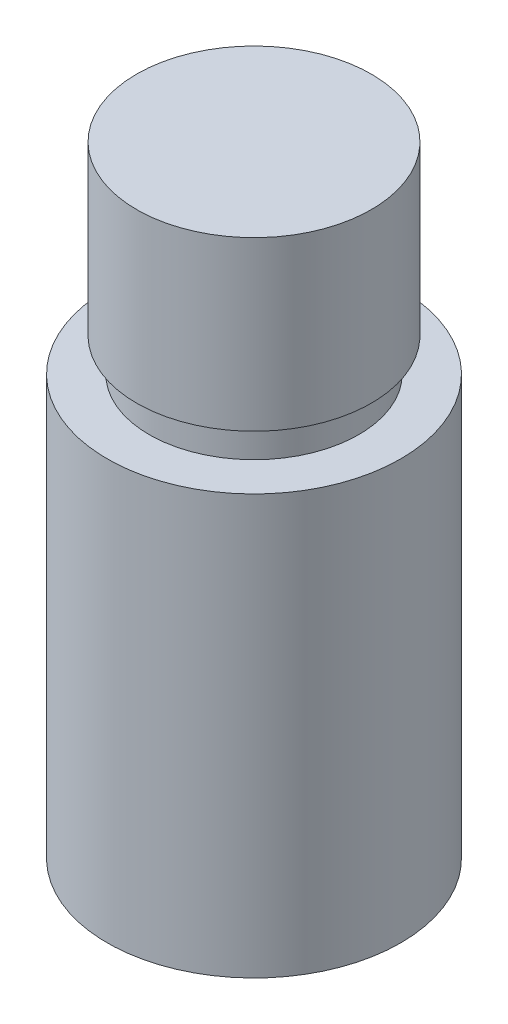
from build123d import *


with BuildPart() as part:
    # Sketch 1 → Revolve 1 (revolve)
    with BuildSketch(Plane.XY):
        Polygon((0, -50), (-35, -50), (-35, 50), (-25, 50), (-25, 58), (-28, 58), (-28, 98), (0, 98), align=None)
    revolve(axis=Axis((0, 98, 0), (0, -1, 0)))


solid = part.part
